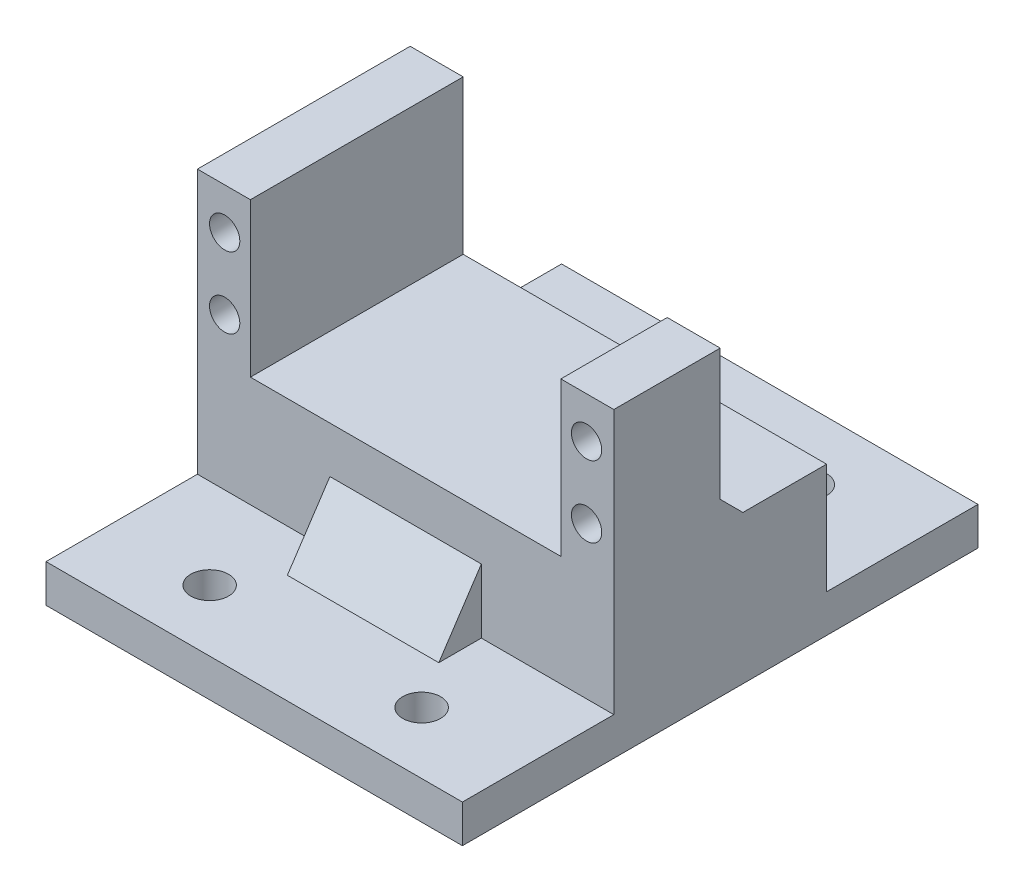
ISO-10303-21;
HEADER;
FILE_DESCRIPTION(('STEP AP214'),'2;1');
FILE_NAME('part.step','',(''),(''),'','','');
FILE_SCHEMA(('AUTOMOTIVE_DESIGN { 1 0 10303 214 1 1 1 1 }'));
ENDSEC;
DATA;
#1=APPLICATION_CONTEXT('core data for automotive mechanical design processes');
#2=APPLICATION_PROTOCOL_DEFINITION('international standard','automotive_design',2000,#1);
#3=PRODUCT_CONTEXT('',#1,'mechanical');
#4=PRODUCT('Part','Part','',(#3));
#5=PRODUCT_RELATED_PRODUCT_CATEGORY('part','',(#4));
#6=PRODUCT_DEFINITION_FORMATION('','',#4);
#7=PRODUCT_DEFINITION_CONTEXT('part definition',#1,'design');
#8=PRODUCT_DEFINITION('design','',#6,#7);
#9=PRODUCT_DEFINITION_SHAPE('','',#8);
#10=(LENGTH_UNIT() NAMED_UNIT(*) SI_UNIT(.MILLI.,.METRE.));
#11=(NAMED_UNIT(*) PLANE_ANGLE_UNIT() SI_UNIT($,.RADIAN.));
#12=(NAMED_UNIT(*) SI_UNIT($,.STERADIAN.) SOLID_ANGLE_UNIT());
#13=UNCERTAINTY_MEASURE_WITH_UNIT(LENGTH_MEASURE(1.E-05),#10,'distance_accuracy_value','');
#14=(GEOMETRIC_REPRESENTATION_CONTEXT(3) GLOBAL_UNCERTAINTY_ASSIGNED_CONTEXT((#13)) GLOBAL_UNIT_ASSIGNED_CONTEXT((#10,
#11,#12)) REPRESENTATION_CONTEXT('',''));
#15=CARTESIAN_POINT('',(0.,0.,0.));
#16=DIRECTION('',(0.,0.,1.));
#17=DIRECTION('',(1.,0.,0.));
#18=AXIS2_PLACEMENT_3D('',#15,#16,#17);
#19=CARTESIAN_POINT('',(-18.8461538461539,39.9,-12.2435897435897));
#20=DIRECTION('',(0.,0.,1.));
#21=DIRECTION('',(1.,0.,0.));
#22=AXIS2_PLACEMENT_3D('',#19,#20,#21);
#23=PLANE('',#22);
#24=CARTESIAN_POINT('',(-15.2461538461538,25.05,-12.2435897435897));
#25=DIRECTION('',(0.,0.,1.));
#26=DIRECTION('',(1.,0.,0.));
#27=AXIS2_PLACEMENT_3D('',#24,#25,#26);
#28=CIRCLE('',#27,2.);
#29=CARTESIAN_POINT('',(-13.2461538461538,25.05,-12.2435897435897));
#30=VERTEX_POINT('',#29);
#31=EDGE_CURVE('E265',#30,#30,#28,.T.);
#32=ORIENTED_EDGE('',*,*,#31,.T.);
#33=EDGE_LOOP('',(#32));
#34=FACE_BOUND('',#33,.T.);
#35=CARTESIAN_POINT('',(-15.2461538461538,34.45,-12.2435897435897));
#36=DIRECTION('',(0.,0.,1.));
#37=DIRECTION('',(1.,0.,0.));
#38=AXIS2_PLACEMENT_3D('',#35,#36,#37);
#39=CIRCLE('',#38,2.00000000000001);
#40=CARTESIAN_POINT('',(-13.2461538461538,34.45,-12.2435897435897));
#41=VERTEX_POINT('',#40);
#42=EDGE_CURVE('E226',#41,#41,#39,.T.);
#43=ORIENTED_EDGE('',*,*,#42,.T.);
#44=EDGE_LOOP('',(#43));
#45=FACE_BOUND('',#44,.T.);
#46=DIRECTION('',(-1.,0.,0.));
#47=VECTOR('',#46,1.);
#48=CARTESIAN_POINT('',(29.1538461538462,19.6,-12.2435897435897));
#49=LINE('',#48,#47);
#50=CARTESIAN_POINT('',(36.1538461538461,19.6,-12.2435897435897));
#51=VERTEX_POINT('',#50);
#52=CARTESIAN_POINT('',(-11.8461538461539,19.6,-12.2435897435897));
#53=VERTEX_POINT('',#52);
#54=EDGE_CURVE('E220',#51,#53,#49,.T.);
#55=ORIENTED_EDGE('',*,*,#54,.F.);
#56=DIRECTION('',(0.,-1.,0.));
#57=VECTOR('',#56,1.);
#58=CARTESIAN_POINT('',(36.1538461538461,39.9,-12.2435897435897));
#59=LINE('',#58,#57);
#60=CARTESIAN_POINT('',(36.1538461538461,5.,-12.2435897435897));
#61=VERTEX_POINT('',#60);
#62=EDGE_CURVE('E253',#51,#61,#59,.T.);
#63=ORIENTED_EDGE('',*,*,#62,.T.);
#64=DIRECTION('',(1.,0.,0.));
#65=VECTOR('',#64,1.);
#66=CARTESIAN_POINT('',(-39.4616819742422,5.,-12.2435897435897));
#67=LINE('',#66,#65);
#68=CARTESIAN_POINT('',(18.6538461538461,5.,-12.2435897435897));
#69=VERTEX_POINT('',#68);
#70=EDGE_CURVE('E365',#69,#61,#67,.T.);
#71=ORIENTED_EDGE('',*,*,#70,.F.);
#72=DIRECTION('',(0.,-1.,0.));
#73=VECTOR('',#72,1.);
#74=CARTESIAN_POINT('',(18.6538461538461,39.9,-12.2435897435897));
#75=LINE('',#74,#73);
#76=CARTESIAN_POINT('',(18.6538461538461,13.4786750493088,-12.2435897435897));
#77=VERTEX_POINT('',#76);
#78=EDGE_CURVE('E316',#77,#69,#75,.T.);
#79=ORIENTED_EDGE('',*,*,#78,.F.);
#80=DIRECTION('',(-1.,0.,0.));
#81=VECTOR('',#80,1.);
#82=CARTESIAN_POINT('',(-18.8461538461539,13.4786750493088,-12.2435897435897));
#83=LINE('',#82,#81);
#84=CARTESIAN_POINT('',(-1.34615384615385,13.4786750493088,-12.2435897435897));
#85=VERTEX_POINT('',#84);
#86=EDGE_CURVE('E322',#77,#85,#83,.T.);
#87=ORIENTED_EDGE('',*,*,#86,.T.);
#88=DIRECTION('',(0.,-1.,0.));
#89=VECTOR('',#88,1.);
#90=CARTESIAN_POINT('',(-1.34615384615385,39.9,-12.2435897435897));
#91=LINE('',#90,#89);
#92=CARTESIAN_POINT('',(-1.34615384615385,5.,-12.2435897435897));
#93=VERTEX_POINT('',#92);
#94=EDGE_CURVE('E320',#85,#93,#91,.T.);
#95=ORIENTED_EDGE('',*,*,#94,.T.);
#96=CARTESIAN_POINT('',(-18.8461538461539,5.,-12.2435897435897));
#97=VERTEX_POINT('',#96);
#98=EDGE_CURVE('E354',#97,#93,#67,.T.);
#99=ORIENTED_EDGE('',*,*,#98,.F.);
#100=DIRECTION('',(0.,-1.,0.));
#101=VECTOR('',#100,1.);
#102=CARTESIAN_POINT('',(-18.8461538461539,39.9,-12.2435897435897));
#103=LINE('',#102,#101);
#104=CARTESIAN_POINT('',(-18.8461538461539,39.9,-12.2435897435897));
#105=VERTEX_POINT('',#104);
#106=EDGE_CURVE('E247',#105,#97,#103,.T.);
#107=ORIENTED_EDGE('',*,*,#106,.F.);
#108=DIRECTION('',(-1.,0.,0.));
#109=VECTOR('',#108,1.);
#110=CARTESIAN_POINT('',(-18.8461538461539,39.9,-12.2435897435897));
#111=LINE('',#110,#109);
#112=CARTESIAN_POINT('',(-11.8461538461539,39.9,-12.2435897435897));
#113=VERTEX_POINT('',#112);
#114=EDGE_CURVE('E245',#113,#105,#111,.T.);
#115=ORIENTED_EDGE('',*,*,#114,.F.);
#116=DIRECTION('',(0.,1.,0.));
#117=VECTOR('',#116,1.);
#118=CARTESIAN_POINT('',(-11.8461538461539,19.6,-12.2435897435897));
#119=LINE('',#118,#117);
#120=EDGE_CURVE('E234',#53,#113,#119,.T.);
#121=ORIENTED_EDGE('',*,*,#120,.F.);
#122=EDGE_LOOP('',(#55,#63,#71,#79,#87,#95,#99,#107,#115,#121));
#123=FACE_BOUND('',#122,.T.);
#124=ADVANCED_FACE('F35',(#34,#45,#123),#23,.F.);
#125=CARTESIAN_POINT('',(-18.8461538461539,39.9,15.8564102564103));
#126=DIRECTION('',(0.,0.,-1.));
#127=DIRECTION('',(-1.,0.,0.));
#128=AXIS2_PLACEMENT_3D('',#125,#126,#127);
#129=PLANE('',#128);
#130=CARTESIAN_POINT('',(-15.2461538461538,34.45,15.8564102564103));
#131=DIRECTION('',(0.,0.,1.));
#132=DIRECTION('',(1.,0.,0.));
#133=AXIS2_PLACEMENT_3D('',#130,#131,#132);
#134=CIRCLE('',#133,2.00000000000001);
#135=CARTESIAN_POINT('',(-13.2461538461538,34.45,15.8564102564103));
#136=VERTEX_POINT('',#135);
#137=EDGE_CURVE('E264',#136,#136,#134,.T.);
#138=ORIENTED_EDGE('',*,*,#137,.F.);
#139=EDGE_LOOP('',(#138));
#140=FACE_BOUND('',#139,.T.);
#141=CARTESIAN_POINT('',(-15.2461538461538,25.05,15.8564102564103));
#142=DIRECTION('',(0.,0.,1.));
#143=DIRECTION('',(1.,0.,0.));
#144=AXIS2_PLACEMENT_3D('',#141,#142,#143);
#145=CIRCLE('',#144,2.);
#146=CARTESIAN_POINT('',(-13.2461538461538,25.05,15.8564102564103));
#147=VERTEX_POINT('',#146);
#148=EDGE_CURVE('E268',#147,#147,#145,.T.);
#149=ORIENTED_EDGE('',*,*,#148,.F.);
#150=EDGE_LOOP('',(#149));
#151=FACE_BOUND('',#150,.T.);
#152=DIRECTION('',(1.,0.,0.));
#153=VECTOR('',#152,1.);
#154=CARTESIAN_POINT('',(-39.4616819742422,5.,15.8564102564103));
#155=LINE('',#154,#153);
#156=CARTESIAN_POINT('',(-18.8461538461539,5.,15.8564102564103));
#157=VERTEX_POINT('',#156);
#158=CARTESIAN_POINT('',(-1.34615384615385,5.,15.8564102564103));
#159=VERTEX_POINT('',#158);
#160=EDGE_CURVE('E384',#157,#159,#155,.T.);
#161=ORIENTED_EDGE('',*,*,#160,.T.);
#162=DIRECTION('',(0.,1.,0.));
#163=VECTOR('',#162,1.);
#164=CARTESIAN_POINT('',(-1.34615384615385,39.9,15.8564102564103));
#165=LINE('',#164,#163);
#166=CARTESIAN_POINT('',(-1.34615384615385,13.4786750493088,15.8564102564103));
#167=VERTEX_POINT('',#166);
#168=EDGE_CURVE('E307',#159,#167,#165,.T.);
#169=ORIENTED_EDGE('',*,*,#168,.T.);
#170=DIRECTION('',(-1.,0.,0.));
#171=VECTOR('',#170,1.);
#172=CARTESIAN_POINT('',(-18.8461538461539,13.4786750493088,15.8564102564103));
#173=LINE('',#172,#171);
#174=CARTESIAN_POINT('',(18.6538461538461,13.4786750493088,15.8564102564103));
#175=VERTEX_POINT('',#174);
#176=EDGE_CURVE('E309',#167,#175,#173,.F.);
#177=ORIENTED_EDGE('',*,*,#176,.T.);
#178=DIRECTION('',(0.,1.,0.));
#179=VECTOR('',#178,1.);
#180=CARTESIAN_POINT('',(18.6538461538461,39.9,15.8564102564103));
#181=LINE('',#180,#179);
#182=CARTESIAN_POINT('',(18.6538461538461,5.,15.8564102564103));
#183=VERTEX_POINT('',#182);
#184=EDGE_CURVE('E303',#183,#175,#181,.T.);
#185=ORIENTED_EDGE('',*,*,#184,.F.);
#186=CARTESIAN_POINT('',(36.1538461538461,5.,15.8564102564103));
#187=VERTEX_POINT('',#186);
#188=EDGE_CURVE('E380',#183,#187,#155,.T.);
#189=ORIENTED_EDGE('',*,*,#188,.T.);
#190=DIRECTION('',(0.,-1.,0.));
#191=VECTOR('',#190,1.);
#192=CARTESIAN_POINT('',(36.1538461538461,39.9,15.8564102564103));
#193=LINE('',#192,#191);
#194=CARTESIAN_POINT('',(36.1538461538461,39.9,15.8564102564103));
#195=VERTEX_POINT('',#194);
#196=EDGE_CURVE('E255',#195,#187,#193,.T.);
#197=ORIENTED_EDGE('',*,*,#196,.F.);
#198=DIRECTION('',(1.,0.,0.));
#199=VECTOR('',#198,1.);
#200=CARTESIAN_POINT('',(-18.8461538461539,39.9,15.8564102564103));
#201=LINE('',#200,#199);
#202=CARTESIAN_POINT('',(29.1538461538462,39.9,15.8564102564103));
#203=VERTEX_POINT('',#202);
#204=EDGE_CURVE('E239',#203,#195,#201,.T.);
#205=ORIENTED_EDGE('',*,*,#204,.F.);
#206=DIRECTION('',(0.,1.,0.));
#207=VECTOR('',#206,1.);
#208=CARTESIAN_POINT('',(29.1538461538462,19.6,15.8564102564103));
#209=LINE('',#208,#207);
#210=CARTESIAN_POINT('',(29.1538461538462,19.6,15.8564102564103));
#211=VERTEX_POINT('',#210);
#212=EDGE_CURVE('E219',#211,#203,#209,.T.);
#213=ORIENTED_EDGE('',*,*,#212,.F.);
#214=DIRECTION('',(1.,0.,0.));
#215=VECTOR('',#214,1.);
#216=CARTESIAN_POINT('',(-11.8461538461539,19.6,15.8564102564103));
#217=LINE('',#216,#215);
#218=CARTESIAN_POINT('',(-11.8461538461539,19.6,15.8564102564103));
#219=VERTEX_POINT('',#218);
#220=EDGE_CURVE('E427',#219,#211,#217,.T.);
#221=ORIENTED_EDGE('',*,*,#220,.F.);
#222=DIRECTION('',(0.,1.,0.));
#223=VECTOR('',#222,1.);
#224=CARTESIAN_POINT('',(-11.8461538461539,19.6,15.8564102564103));
#225=LINE('',#224,#223);
#226=CARTESIAN_POINT('',(-11.8461538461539,39.9,15.8564102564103));
#227=VERTEX_POINT('',#226);
#228=EDGE_CURVE('E232',#219,#227,#225,.T.);
#229=ORIENTED_EDGE('',*,*,#228,.T.);
#230=CARTESIAN_POINT('',(-18.8461538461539,39.9,15.8564102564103));
#231=VERTEX_POINT('',#230);
#232=EDGE_CURVE('E241',#231,#227,#201,.T.);
#233=ORIENTED_EDGE('',*,*,#232,.F.);
#234=DIRECTION('',(0.,-1.,0.));
#235=VECTOR('',#234,1.);
#236=CARTESIAN_POINT('',(-18.8461538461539,39.9,15.8564102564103));
#237=LINE('',#236,#235);
#238=EDGE_CURVE('E258',#231,#157,#237,.T.);
#239=ORIENTED_EDGE('',*,*,#238,.T.);
#240=EDGE_LOOP('',(#161,#169,#177,#185,#189,#197,#205,#213,#221,#229,#233,#239));
#241=FACE_BOUND('',#240,.T.);
#242=CARTESIAN_POINT('',(32.5538461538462,34.45,15.8564102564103));
#243=DIRECTION('',(0.,0.,1.));
#244=DIRECTION('',(1.,0.,0.));
#245=AXIS2_PLACEMENT_3D('',#242,#243,#244);
#246=CIRCLE('',#245,2.);
#247=CARTESIAN_POINT('',(34.5538461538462,34.45,15.8564102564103));
#248=VERTEX_POINT('',#247);
#249=EDGE_CURVE('E418',#248,#248,#246,.T.);
#250=ORIENTED_EDGE('',*,*,#249,.F.);
#251=EDGE_LOOP('',(#250));
#252=FACE_BOUND('',#251,.T.);
#253=CARTESIAN_POINT('',(32.5538461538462,25.05,15.8564102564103));
#254=DIRECTION('',(0.,0.,1.));
#255=DIRECTION('',(1.,0.,0.));
#256=AXIS2_PLACEMENT_3D('',#253,#254,#255);
#257=CIRCLE('',#256,2.);
#258=CARTESIAN_POINT('',(34.5538461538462,25.05,15.8564102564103));
#259=VERTEX_POINT('',#258);
#260=EDGE_CURVE('E409',#259,#259,#257,.T.);
#261=ORIENTED_EDGE('',*,*,#260,.F.);
#262=EDGE_LOOP('',(#261));
#263=FACE_BOUND('',#262,.T.);
#264=ADVANCED_FACE('F432',(#140,#151,#241,#252,#263),#129,.F.);
#265=CARTESIAN_POINT('',(0.,39.9,0.));
#266=DIRECTION('',(0.,1.,0.));
#267=DIRECTION('',(0.,0.,1.));
#268=AXIS2_PLACEMENT_3D('',#265,#266,#267);
#269=PLANE('',#268);
#270=DIRECTION('',(1.,0.,0.));
#271=VECTOR('',#270,1.);
#272=CARTESIAN_POINT('',(29.1538461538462,39.9,1.80641025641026));
#273=LINE('',#272,#271);
#274=CARTESIAN_POINT('',(29.1538461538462,39.9,1.80641025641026));
#275=VERTEX_POINT('',#274);
#276=CARTESIAN_POINT('',(36.1538461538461,39.9,1.80641025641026));
#277=VERTEX_POINT('',#276);
#278=EDGE_CURVE('E201',#275,#277,#273,.T.);
#279=ORIENTED_EDGE('',*,*,#278,.F.);
#280=DIRECTION('',(0.,0.,-1.));
#281=VECTOR('',#280,1.);
#282=CARTESIAN_POINT('',(29.1538461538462,39.9,15.8564102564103));
#283=LINE('',#282,#281);
#284=EDGE_CURVE('E212',#203,#275,#283,.T.);
#285=ORIENTED_EDGE('',*,*,#284,.F.);
#286=ORIENTED_EDGE('',*,*,#204,.T.);
#287=DIRECTION('',(0.,0.,-1.));
#288=VECTOR('',#287,1.);
#289=CARTESIAN_POINT('',(36.1538461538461,39.9,-12.2435897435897));
#290=LINE('',#289,#288);
#291=EDGE_CURVE('E215',#195,#277,#290,.T.);
#292=ORIENTED_EDGE('',*,*,#291,.T.);
#293=EDGE_LOOP('',(#279,#285,#286,#292));
#294=FACE_BOUND('',#293,.T.);
#295=ADVANCED_FACE('F211',(#294),#269,.T.);
#296=CARTESIAN_POINT('',(-18.8461538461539,39.9,-12.2435897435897));
#297=DIRECTION('',(1.,0.,0.));
#298=DIRECTION('',(0.,0.,-1.));
#299=AXIS2_PLACEMENT_3D('',#296,#297,#298);
#300=PLANE('',#299);
#301=ORIENTED_EDGE('',*,*,#106,.T.);
#302=DIRECTION('',(0.,0.,-1.));
#303=VECTOR('',#302,1.);
#304=CARTESIAN_POINT('',(-18.8461538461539,5.,-32.2435897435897));
#305=LINE('',#304,#303);
#306=CARTESIAN_POINT('',(-18.8461538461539,5.,-32.2435897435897));
#307=VERTEX_POINT('',#306);
#308=EDGE_CURVE('E353',#97,#307,#305,.T.);
#309=ORIENTED_EDGE('',*,*,#308,.T.);
#310=DIRECTION('',(0.,-1.,0.));
#311=VECTOR('',#310,1.);
#312=CARTESIAN_POINT('',(-18.8461538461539,0.,-32.2435897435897));
#313=LINE('',#312,#311);
#314=CARTESIAN_POINT('',(-18.8461538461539,0.,-32.2435897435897));
#315=VERTEX_POINT('',#314);
#316=EDGE_CURVE('E350',#307,#315,#313,.T.);
#317=ORIENTED_EDGE('',*,*,#316,.T.);
#318=DIRECTION('',(0.,0.,1.));
#319=VECTOR('',#318,1.);
#320=CARTESIAN_POINT('',(-18.8461538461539,0.,-12.2435897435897));
#321=LINE('',#320,#319);
#322=CARTESIAN_POINT('',(-18.8461538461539,0.,35.8564102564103));
#323=VERTEX_POINT('',#322);
#324=EDGE_CURVE('E231',#315,#323,#321,.T.);
#325=ORIENTED_EDGE('',*,*,#324,.T.);
#326=DIRECTION('',(0.,1.,0.));
#327=VECTOR('',#326,1.);
#328=CARTESIAN_POINT('',(-18.8461538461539,0.,35.8564102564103));
#329=LINE('',#328,#327);
#330=CARTESIAN_POINT('',(-18.8461538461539,4.99999999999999,35.8564102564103));
#331=VERTEX_POINT('',#330);
#332=EDGE_CURVE('E371',#323,#331,#329,.T.);
#333=ORIENTED_EDGE('',*,*,#332,.T.);
#334=DIRECTION('',(0.,0.,-1.));
#335=VECTOR('',#334,1.);
#336=CARTESIAN_POINT('',(-18.8461538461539,4.99999999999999,35.8564102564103));
#337=LINE('',#336,#335);
#338=EDGE_CURVE('E373',#331,#157,#337,.T.);
#339=ORIENTED_EDGE('',*,*,#338,.T.);
#340=ORIENTED_EDGE('',*,*,#238,.F.);
#341=DIRECTION('',(0.,0.,1.));
#342=VECTOR('',#341,1.);
#343=CARTESIAN_POINT('',(-18.8461538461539,39.9,-12.2435897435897));
#344=LINE('',#343,#342);
#345=EDGE_CURVE('E236',#105,#231,#344,.T.);
#346=ORIENTED_EDGE('',*,*,#345,.F.);
#347=EDGE_LOOP('',(#301,#309,#317,#325,#333,#339,#340,#346));
#348=FACE_BOUND('',#347,.T.);
#349=ADVANCED_FACE('F481',(#348),#300,.F.);
#350=CARTESIAN_POINT('',(36.1538461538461,39.9,-12.2435897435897));
#351=DIRECTION('',(-1.,0.,0.));
#352=DIRECTION('',(0.,0.,1.));
#353=AXIS2_PLACEMENT_3D('',#350,#351,#352);
#354=PLANE('',#353);
#355=DIRECTION('',(0.,0.,1.));
#356=VECTOR('',#355,1.);
#357=CARTESIAN_POINT('',(36.1538461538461,19.6,-2.24358974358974));
#358=LINE('',#357,#356);
#359=CARTESIAN_POINT('',(36.1538461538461,19.6,-1.19358974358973));
#360=VERTEX_POINT('',#359);
#361=EDGE_CURVE('E283',#51,#360,#358,.T.);
#362=ORIENTED_EDGE('',*,*,#361,.T.);
#363=DIRECTION('',(0.,0.707106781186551,0.707106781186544));
#364=VECTOR('',#363,1.);
#365=CARTESIAN_POINT('',(36.1538461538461,24.2250000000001,3.43141025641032));
#366=LINE('',#365,#364);
#367=CARTESIAN_POINT('',(36.1538461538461,22.6,1.80641025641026));
#368=VERTEX_POINT('',#367);
#369=EDGE_CURVE('E11',#360,#368,#366,.T.);
#370=ORIENTED_EDGE('',*,*,#369,.T.);
#371=DIRECTION('',(0.,1.,0.));
#372=VECTOR('',#371,1.);
#373=CARTESIAN_POINT('',(36.1538461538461,3.90278687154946,1.80641025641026));
#374=LINE('',#373,#372);
#375=EDGE_CURVE('E207',#368,#277,#374,.T.);
#376=ORIENTED_EDGE('',*,*,#375,.T.);
#377=ORIENTED_EDGE('',*,*,#291,.F.);
#378=ORIENTED_EDGE('',*,*,#196,.T.);
#379=DIRECTION('',(0.,0.,1.));
#380=VECTOR('',#379,1.);
#381=CARTESIAN_POINT('',(36.1538461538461,4.99999999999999,35.8564102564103));
#382=LINE('',#381,#380);
#383=CARTESIAN_POINT('',(36.1538461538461,4.99999999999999,35.8564102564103));
#384=VERTEX_POINT('',#383);
#385=EDGE_CURVE('E356',#187,#384,#382,.T.);
#386=ORIENTED_EDGE('',*,*,#385,.T.);
#387=DIRECTION('',(0.,-1.,0.));
#388=VECTOR('',#387,1.);
#389=CARTESIAN_POINT('',(36.1538461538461,0.,35.8564102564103));
#390=LINE('',#389,#388);
#391=CARTESIAN_POINT('',(36.1538461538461,0.,35.8564102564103));
#392=VERTEX_POINT('',#391);
#393=EDGE_CURVE('E377',#384,#392,#390,.T.);
#394=ORIENTED_EDGE('',*,*,#393,.T.);
#395=DIRECTION('',(0.,0.,-1.));
#396=VECTOR('',#395,1.);
#397=CARTESIAN_POINT('',(36.1538461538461,0.,-12.2435897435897));
#398=LINE('',#397,#396);
#399=CARTESIAN_POINT('',(36.1538461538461,0.,-32.2435897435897));
#400=VERTEX_POINT('',#399);
#401=EDGE_CURVE('E240',#392,#400,#398,.T.);
#402=ORIENTED_EDGE('',*,*,#401,.T.);
#403=DIRECTION('',(0.,1.,0.));
#404=VECTOR('',#403,1.);
#405=CARTESIAN_POINT('',(36.1538461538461,0.,-32.2435897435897));
#406=LINE('',#405,#404);
#407=CARTESIAN_POINT('',(36.1538461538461,5.,-32.2435897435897));
#408=VERTEX_POINT('',#407);
#409=EDGE_CURVE('E349',#400,#408,#406,.T.);
#410=ORIENTED_EDGE('',*,*,#409,.T.);
#411=DIRECTION('',(0.,0.,1.));
#412=VECTOR('',#411,1.);
#413=CARTESIAN_POINT('',(36.1538461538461,5.,-32.2435897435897));
#414=LINE('',#413,#412);
#415=EDGE_CURVE('E359',#408,#61,#414,.T.);
#416=ORIENTED_EDGE('',*,*,#415,.T.);
#417=ORIENTED_EDGE('',*,*,#62,.F.);
#418=EDGE_LOOP('',(#362,#370,#376,#377,#378,#386,#394,#402,#410,#416,#417));
#419=FACE_BOUND('',#418,.T.);
#420=ADVANCED_FACE('F288',(#419),#354,.F.);
#421=DIRECTION('',(0.,0.,1.));
#422=VECTOR('',#421,1.);
#423=CARTESIAN_POINT('',(-11.8461538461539,39.9,-12.2435897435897));
#424=LINE('',#423,#422);
#425=EDGE_CURVE('E221',#113,#227,#424,.T.);
#426=ORIENTED_EDGE('',*,*,#425,.F.);
#427=ORIENTED_EDGE('',*,*,#114,.T.);
#428=ORIENTED_EDGE('',*,*,#345,.T.);
#429=ORIENTED_EDGE('',*,*,#232,.T.);
#430=EDGE_LOOP('',(#426,#427,#428,#429));
#431=FACE_BOUND('',#430,.T.);
#432=ADVANCED_FACE('F479',(#431),#269,.T.);
#433=CARTESIAN_POINT('',(0.,0.,0.));
#434=DIRECTION('',(0.,1.,0.));
#435=DIRECTION('',(0.,0.,1.));
#436=AXIS2_PLACEMENT_3D('',#433,#434,#435);
#437=PLANE('',#436);
#438=DIRECTION('',(0.,0.,-1.));
#439=VECTOR('',#438,1.);
#440=CARTESIAN_POINT('',(26.2871918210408,0.,-11.2435897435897));
#441=LINE('',#440,#439);
#442=CARTESIAN_POINT('',(26.2871918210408,0.,-11.2435897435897));
#443=VERTEX_POINT('',#442);
#444=CARTESIAN_POINT('',(26.2871918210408,0.,-12.2435897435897));
#445=VERTEX_POINT('',#444);
#446=EDGE_CURVE('E399',#443,#445,#441,.T.);
#447=ORIENTED_EDGE('',*,*,#446,.T.);
#448=DIRECTION('',(1.,0.,0.));
#449=VECTOR('',#448,1.);
#450=CARTESIAN_POINT('',(-39.4616819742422,0.,-12.2435897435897));
#451=LINE('',#450,#449);
#452=CARTESIAN_POINT('',(-10.545838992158,0.,-12.2435897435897));
#453=VERTEX_POINT('',#452);
#454=EDGE_CURVE('E362',#453,#445,#451,.T.);
#455=ORIENTED_EDGE('',*,*,#454,.F.);
#456=DIRECTION('',(0.,0.,-1.));
#457=VECTOR('',#456,1.);
#458=CARTESIAN_POINT('',(-10.545838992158,0.,-11.2435897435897));
#459=LINE('',#458,#457);
#460=CARTESIAN_POINT('',(-10.545838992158,0.,-11.2435897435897));
#461=VERTEX_POINT('',#460);
#462=EDGE_CURVE('E412',#461,#453,#459,.T.);
#463=ORIENTED_EDGE('',*,*,#462,.F.);
#464=DIRECTION('',(-1.,0.,0.));
#465=VECTOR('',#464,1.);
#466=CARTESIAN_POINT('',(26.2871918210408,0.,-11.2435897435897));
#467=LINE('',#466,#465);
#468=EDGE_CURVE('E391',#443,#461,#467,.T.);
#469=ORIENTED_EDGE('',*,*,#468,.F.);
#470=EDGE_LOOP('',(#447,#455,#463,#469));
#471=FACE_BOUND('',#470,.T.);
#472=DIRECTION('',(1.,0.,0.));
#473=VECTOR('',#472,1.);
#474=CARTESIAN_POINT('',(-39.4616819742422,0.,-32.2435897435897));
#475=LINE('',#474,#473);
#476=EDGE_CURVE('E368',#315,#400,#475,.T.);
#477=ORIENTED_EDGE('',*,*,#476,.T.);
#478=ORIENTED_EDGE('',*,*,#401,.F.);
#479=DIRECTION('',(1.,0.,0.));
#480=VECTOR('',#479,1.);
#481=CARTESIAN_POINT('',(-39.4616819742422,0.,35.8564102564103));
#482=LINE('',#481,#480);
#483=EDGE_CURVE('E374',#323,#392,#482,.T.);
#484=ORIENTED_EDGE('',*,*,#483,.F.);
#485=ORIENTED_EDGE('',*,*,#324,.F.);
#486=EDGE_LOOP('',(#477,#478,#484,#485));
#487=FACE_BOUND('',#486,.T.);
#488=CARTESIAN_POINT('',(22.6538461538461,0.,-23.2641644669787));
#489=DIRECTION('',(0.,1.,0.));
#490=DIRECTION('',(0.,0.,1.));
#491=AXIS2_PLACEMENT_3D('',#488,#489,#490);
#492=CIRCLE('',#491,2.5);
#493=CARTESIAN_POINT('',(22.6538461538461,0.,-20.7641644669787));
#494=VERTEX_POINT('',#493);
#495=EDGE_CURVE('E329',#494,#494,#492,.T.);
#496=ORIENTED_EDGE('',*,*,#495,.T.);
#497=EDGE_LOOP('',(#496));
#498=FACE_BOUND('',#497,.T.);
#499=CARTESIAN_POINT('',(-5.34615384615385,0.,27.740984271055));
#500=DIRECTION('',(0.,1.,0.));
#501=DIRECTION('',(0.,0.,1.));
#502=AXIS2_PLACEMENT_3D('',#499,#500,#501);
#503=CIRCLE('',#502,2.5);
#504=CARTESIAN_POINT('',(-5.34615384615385,0.,30.240984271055));
#505=VERTEX_POINT('',#504);
#506=EDGE_CURVE('E340',#505,#505,#503,.T.);
#507=ORIENTED_EDGE('',*,*,#506,.T.);
#508=EDGE_LOOP('',(#507));
#509=FACE_BOUND('',#508,.T.);
#510=CARTESIAN_POINT('',(22.6538461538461,0.,27.740984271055));
#511=DIRECTION('',(0.,1.,0.));
#512=DIRECTION('',(0.,0.,1.));
#513=AXIS2_PLACEMENT_3D('',#510,#511,#512);
#514=CIRCLE('',#513,2.5);
#515=CARTESIAN_POINT('',(22.6538461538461,0.,30.240984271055));
#516=VERTEX_POINT('',#515);
#517=EDGE_CURVE('E337',#516,#516,#514,.T.);
#518=ORIENTED_EDGE('',*,*,#517,.T.);
#519=EDGE_LOOP('',(#518));
#520=FACE_BOUND('',#519,.T.);
#521=CARTESIAN_POINT('',(-5.34615384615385,0.,-23.2641644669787));
#522=DIRECTION('',(0.,1.,0.));
#523=DIRECTION('',(0.,0.,1.));
#524=AXIS2_PLACEMENT_3D('',#521,#522,#523);
#525=CIRCLE('',#524,2.5);
#526=CARTESIAN_POINT('',(-5.34615384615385,0.,-20.7641644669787));
#527=VERTEX_POINT('',#526);
#528=EDGE_CURVE('E346',#527,#527,#525,.T.);
#529=ORIENTED_EDGE('',*,*,#528,.T.);
#530=EDGE_LOOP('',(#529));
#531=FACE_BOUND('',#530,.T.);
#532=ADVANCED_FACE('F452',(#471,#487,#498,#509,#520,#531),#437,.F.);
#533=CARTESIAN_POINT('',(29.1538461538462,19.6,15.8564102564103));
#534=DIRECTION('',(1.,0.,0.));
#535=DIRECTION('',(0.,0.,-1.));
#536=AXIS2_PLACEMENT_3D('',#533,#534,#535);
#537=PLANE('',#536);
#538=ORIENTED_EDGE('',*,*,#284,.T.);
#539=DIRECTION('',(0.,1.,0.));
#540=VECTOR('',#539,1.);
#541=CARTESIAN_POINT('',(29.1538461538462,3.90278687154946,1.80641025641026));
#542=LINE('',#541,#540);
#543=CARTESIAN_POINT('',(29.1538461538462,22.6,1.80641025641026));
#544=VERTEX_POINT('',#543);
#545=EDGE_CURVE('E196',#544,#275,#542,.T.);
#546=ORIENTED_EDGE('',*,*,#545,.F.);
#547=DIRECTION('',(0.,-0.707106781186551,-0.707106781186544));
#548=VECTOR('',#547,1.);
#549=CARTESIAN_POINT('',(29.1538461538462,28.125,7.33141025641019));
#550=LINE('',#549,#548);
#551=CARTESIAN_POINT('',(29.1538461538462,19.6,-1.19358974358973));
#552=VERTEX_POINT('',#551);
#553=EDGE_CURVE('E43',#544,#552,#550,.T.);
#554=ORIENTED_EDGE('',*,*,#553,.T.);
#555=DIRECTION('',(0.,0.,-1.));
#556=VECTOR('',#555,1.);
#557=CARTESIAN_POINT('',(29.1538461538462,19.6,15.8564102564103));
#558=LINE('',#557,#556);
#559=EDGE_CURVE('E50',#211,#552,#558,.T.);
#560=ORIENTED_EDGE('',*,*,#559,.F.);
#561=ORIENTED_EDGE('',*,*,#212,.T.);
#562=EDGE_LOOP('',(#538,#546,#554,#560,#561));
#563=FACE_BOUND('',#562,.T.);
#564=ADVANCED_FACE('F217',(#563),#537,.F.);
#565=CARTESIAN_POINT('',(-11.8461538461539,19.6,-12.2435897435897));
#566=DIRECTION('',(-1.,0.,0.));
#567=DIRECTION('',(0.,0.,1.));
#568=AXIS2_PLACEMENT_3D('',#565,#566,#567);
#569=PLANE('',#568);
#570=ORIENTED_EDGE('',*,*,#425,.T.);
#571=ORIENTED_EDGE('',*,*,#228,.F.);
#572=DIRECTION('',(0.,0.,1.));
#573=VECTOR('',#572,1.);
#574=CARTESIAN_POINT('',(-11.8461538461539,19.6,-12.2435897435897));
#575=LINE('',#574,#573);
#576=EDGE_CURVE('E223',#53,#219,#575,.T.);
#577=ORIENTED_EDGE('',*,*,#576,.F.);
#578=ORIENTED_EDGE('',*,*,#120,.T.);
#579=EDGE_LOOP('',(#570,#571,#577,#578));
#580=FACE_BOUND('',#579,.T.);
#581=ADVANCED_FACE('F475',(#580),#569,.F.);
#582=CARTESIAN_POINT('',(0.,19.6,0.));
#583=DIRECTION('',(0.,1.,0.));
#584=DIRECTION('',(0.,0.,1.));
#585=AXIS2_PLACEMENT_3D('',#582,#583,#584);
#586=PLANE('',#585);
#587=ORIENTED_EDGE('',*,*,#559,.T.);
#588=DIRECTION('',(1.,0.,0.));
#589=VECTOR('',#588,1.);
#590=CARTESIAN_POINT('',(0.,19.6,-1.19358974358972));
#591=LINE('',#590,#589);
#592=EDGE_CURVE('E55',#552,#360,#591,.T.);
#593=ORIENTED_EDGE('',*,*,#592,.T.);
#594=ORIENTED_EDGE('',*,*,#361,.F.);
#595=ORIENTED_EDGE('',*,*,#54,.T.);
#596=ORIENTED_EDGE('',*,*,#576,.T.);
#597=ORIENTED_EDGE('',*,*,#220,.T.);
#598=EDGE_LOOP('',(#587,#593,#594,#595,#596,#597));
#599=FACE_BOUND('',#598,.T.);
#600=ADVANCED_FACE('F428',(#599),#586,.T.);
#601=CARTESIAN_POINT('',(-15.2461538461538,34.45,-22.1435897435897));
#602=DIRECTION('',(0.,0.,1.));
#603=DIRECTION('',(1.,0.,0.));
#604=AXIS2_PLACEMENT_3D('',#601,#602,#603);
#605=CYLINDRICAL_SURFACE('',#604,2.00000000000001);
#606=ORIENTED_EDGE('',*,*,#137,.T.);
#607=EDGE_LOOP('',(#606));
#608=FACE_BOUND('',#607,.T.);
#609=ORIENTED_EDGE('',*,*,#42,.F.);
#610=EDGE_LOOP('',(#609));
#611=FACE_BOUND('',#610,.T.);
#612=ADVANCED_FACE('F578',(#608,#611),#605,.F.);
#613=CARTESIAN_POINT('',(32.5538461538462,25.05,-22.1435897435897));
#614=DIRECTION('',(0.,0.,1.));
#615=DIRECTION('',(1.,0.,0.));
#616=AXIS2_PLACEMENT_3D('',#613,#614,#615);
#617=CYLINDRICAL_SURFACE('',#616,2.);
#618=CARTESIAN_POINT('',(32.5538461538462,25.05,1.80641025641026));
#619=DIRECTION('',(0.,0.,1.));
#620=DIRECTION('',(1.,0.,0.));
#621=AXIS2_PLACEMENT_3D('',#618,#619,#620);
#622=CIRCLE('',#621,2.);
#623=CARTESIAN_POINT('',(34.5538461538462,25.05,1.80641025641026));
#624=VERTEX_POINT('',#623);
#625=EDGE_CURVE('E282',#624,#624,#622,.F.);
#626=ORIENTED_EDGE('',*,*,#625,.T.);
#627=EDGE_LOOP('',(#626));
#628=FACE_BOUND('',#627,.T.);
#629=ORIENTED_EDGE('',*,*,#260,.T.);
#630=EDGE_LOOP('',(#629));
#631=FACE_BOUND('',#630,.T.);
#632=ADVANCED_FACE('F574',(#628,#631),#617,.F.);
#633=CARTESIAN_POINT('',(32.5538461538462,34.45,-22.1435897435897));
#634=DIRECTION('',(0.,0.,1.));
#635=DIRECTION('',(1.,0.,0.));
#636=AXIS2_PLACEMENT_3D('',#633,#634,#635);
#637=CYLINDRICAL_SURFACE('',#636,2.);
#638=CARTESIAN_POINT('',(32.5538461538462,34.45,1.80641025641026));
#639=DIRECTION('',(0.,0.,1.));
#640=DIRECTION('',(1.,0.,0.));
#641=AXIS2_PLACEMENT_3D('',#638,#639,#640);
#642=CIRCLE('',#641,2.);
#643=CARTESIAN_POINT('',(34.5538461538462,34.45,1.80641025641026));
#644=VERTEX_POINT('',#643);
#645=EDGE_CURVE('E279',#644,#644,#642,.F.);
#646=ORIENTED_EDGE('',*,*,#645,.T.);
#647=EDGE_LOOP('',(#646));
#648=FACE_BOUND('',#647,.T.);
#649=ORIENTED_EDGE('',*,*,#249,.T.);
#650=EDGE_LOOP('',(#649));
#651=FACE_BOUND('',#650,.T.);
#652=ADVANCED_FACE('F570',(#648,#651),#637,.F.);
#653=CARTESIAN_POINT('',(-15.2461538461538,25.05,-22.1435897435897));
#654=DIRECTION('',(0.,0.,1.));
#655=DIRECTION('',(1.,0.,0.));
#656=AXIS2_PLACEMENT_3D('',#653,#654,#655);
#657=CYLINDRICAL_SURFACE('',#656,2.);
#658=ORIENTED_EDGE('',*,*,#148,.T.);
#659=EDGE_LOOP('',(#658));
#660=FACE_BOUND('',#659,.T.);
#661=ORIENTED_EDGE('',*,*,#31,.F.);
#662=EDGE_LOOP('',(#661));
#663=FACE_BOUND('',#662,.T.);
#664=ADVANCED_FACE('F563',(#660,#663),#657,.F.);
#665=CARTESIAN_POINT('',(26.2871918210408,0.,-11.2435897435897));
#666=DIRECTION('',(1.,0.,0.));
#667=DIRECTION('',(0.,0.,-1.));
#668=AXIS2_PLACEMENT_3D('',#665,#666,#667);
#669=PLANE('',#668);
#670=DIRECTION('',(0.,-1.,0.));
#671=VECTOR('',#670,1.);
#672=CARTESIAN_POINT('',(26.2871918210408,0.,-12.2435897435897));
#673=LINE('',#672,#671);
#674=CARTESIAN_POINT('',(26.2871918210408,2.88810167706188,-12.2435897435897));
#675=VERTEX_POINT('',#674);
#676=EDGE_CURVE('E388',#675,#445,#673,.T.);
#677=ORIENTED_EDGE('',*,*,#676,.T.);
#678=ORIENTED_EDGE('',*,*,#446,.F.);
#679=DIRECTION('',(0.,-1.,0.));
#680=VECTOR('',#679,1.);
#681=CARTESIAN_POINT('',(26.2871918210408,0.,-11.2435897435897));
#682=LINE('',#681,#680);
#683=CARTESIAN_POINT('',(26.2871918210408,2.88810167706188,-11.2435897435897));
#684=VERTEX_POINT('',#683);
#685=EDGE_CURVE('E389',#684,#443,#682,.T.);
#686=ORIENTED_EDGE('',*,*,#685,.F.);
#687=DIRECTION('',(0.,0.,-1.));
#688=VECTOR('',#687,1.);
#689=CARTESIAN_POINT('',(26.2871918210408,2.88810167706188,-11.2435897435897));
#690=LINE('',#689,#688);
#691=EDGE_CURVE('E406',#684,#675,#690,.T.);
#692=ORIENTED_EDGE('',*,*,#691,.T.);
#693=EDGE_LOOP('',(#677,#678,#686,#692));
#694=FACE_BOUND('',#693,.T.);
#695=ADVANCED_FACE('F541',(#694),#669,.F.);
#696=CARTESIAN_POINT('',(26.2871918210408,2.88810167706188,-11.2435897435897));
#697=DIRECTION('',(0.,1.,0.));
#698=DIRECTION('',(0.,0.,1.));
#699=AXIS2_PLACEMENT_3D('',#696,#697,#698);
#700=PLANE('',#699);
#701=DIRECTION('',(1.,0.,0.));
#702=VECTOR('',#701,1.);
#703=CARTESIAN_POINT('',(26.2871918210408,2.88810167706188,-12.2435897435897));
#704=LINE('',#703,#702);
#705=CARTESIAN_POINT('',(-10.545838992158,2.88810167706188,-12.2435897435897));
#706=VERTEX_POINT('',#705);
#707=EDGE_CURVE('E392',#706,#675,#704,.T.);
#708=ORIENTED_EDGE('',*,*,#707,.T.);
#709=ORIENTED_EDGE('',*,*,#691,.F.);
#710=DIRECTION('',(1.,0.,0.));
#711=VECTOR('',#710,1.);
#712=CARTESIAN_POINT('',(26.2871918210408,2.88810167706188,-11.2435897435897));
#713=LINE('',#712,#711);
#714=CARTESIAN_POINT('',(-10.545838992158,2.88810167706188,-11.2435897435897));
#715=VERTEX_POINT('',#714);
#716=EDGE_CURVE('E397',#715,#684,#713,.T.);
#717=ORIENTED_EDGE('',*,*,#716,.F.);
#718=DIRECTION('',(0.,0.,-1.));
#719=VECTOR('',#718,1.);
#720=CARTESIAN_POINT('',(-10.545838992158,2.88810167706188,-11.2435897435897));
#721=LINE('',#720,#719);
#722=EDGE_CURVE('E410',#715,#706,#721,.T.);
#723=ORIENTED_EDGE('',*,*,#722,.T.);
#724=EDGE_LOOP('',(#708,#709,#717,#723));
#725=FACE_BOUND('',#724,.T.);
#726=ADVANCED_FACE('F555',(#725),#700,.F.);
#727=CARTESIAN_POINT('',(-10.545838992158,0.,-11.2435897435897));
#728=DIRECTION('',(-1.,0.,0.));
#729=DIRECTION('',(0.,0.,1.));
#730=AXIS2_PLACEMENT_3D('',#727,#728,#729);
#731=PLANE('',#730);
#732=DIRECTION('',(0.,1.,0.));
#733=VECTOR('',#732,1.);
#734=CARTESIAN_POINT('',(-10.545838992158,0.,-12.2435897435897));
#735=LINE('',#734,#733);
#736=EDGE_CURVE('E402',#453,#706,#735,.T.);
#737=ORIENTED_EDGE('',*,*,#736,.T.);
#738=ORIENTED_EDGE('',*,*,#722,.F.);
#739=DIRECTION('',(0.,1.,0.));
#740=VECTOR('',#739,1.);
#741=CARTESIAN_POINT('',(-10.545838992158,0.,-11.2435897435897));
#742=LINE('',#741,#740);
#743=EDGE_CURVE('E394',#461,#715,#742,.T.);
#744=ORIENTED_EDGE('',*,*,#743,.F.);
#745=ORIENTED_EDGE('',*,*,#462,.T.);
#746=EDGE_LOOP('',(#737,#738,#744,#745));
#747=FACE_BOUND('',#746,.T.);
#748=ADVANCED_FACE('F549',(#747),#731,.F.);
#749=CARTESIAN_POINT('',(0.,0.,-11.2435897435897));
#750=DIRECTION('',(0.,0.,1.));
#751=DIRECTION('',(1.,0.,0.));
#752=AXIS2_PLACEMENT_3D('',#749,#750,#751);
#753=PLANE('',#752);
#754=ORIENTED_EDGE('',*,*,#716,.T.);
#755=ORIENTED_EDGE('',*,*,#685,.T.);
#756=ORIENTED_EDGE('',*,*,#468,.T.);
#757=ORIENTED_EDGE('',*,*,#743,.T.);
#758=EDGE_LOOP('',(#754,#755,#756,#757));
#759=FACE_BOUND('',#758,.T.);
#760=ADVANCED_FACE('F553',(#759),#753,.F.);
#761=CARTESIAN_POINT('',(-39.4616819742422,0.,35.8564102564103));
#762=DIRECTION('',(0.,0.,1.));
#763=DIRECTION('',(1.,0.,0.));
#764=AXIS2_PLACEMENT_3D('',#761,#762,#763);
#765=PLANE('',#764);
#766=ORIENTED_EDGE('',*,*,#483,.T.);
#767=ORIENTED_EDGE('',*,*,#393,.F.);
#768=DIRECTION('',(1.,0.,0.));
#769=VECTOR('',#768,1.);
#770=CARTESIAN_POINT('',(-39.4616819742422,4.99999999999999,35.8564102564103));
#771=LINE('',#770,#769);
#772=EDGE_CURVE('E382',#331,#384,#771,.T.);
#773=ORIENTED_EDGE('',*,*,#772,.F.);
#774=ORIENTED_EDGE('',*,*,#332,.F.);
#775=EDGE_LOOP('',(#766,#767,#773,#774));
#776=FACE_BOUND('',#775,.T.);
#777=ADVANCED_FACE('F448',(#776),#765,.T.);
#778=CARTESIAN_POINT('',(-39.4616819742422,4.99999999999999,35.8564102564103));
#779=DIRECTION('',(0.,1.,0.));
#780=DIRECTION('',(0.,0.,1.));
#781=AXIS2_PLACEMENT_3D('',#778,#779,#780);
#782=PLANE('',#781);
#783=DIRECTION('',(0.,0.,1.));
#784=VECTOR('',#783,1.);
#785=CARTESIAN_POINT('',(-1.34615384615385,4.99999999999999,35.8564102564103));
#786=LINE('',#785,#784);
#787=CARTESIAN_POINT('',(-1.34615384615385,5.,21.4764102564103));
#788=VERTEX_POINT('',#787);
#789=EDGE_CURVE('E305',#159,#788,#786,.T.);
#790=ORIENTED_EDGE('',*,*,#789,.F.);
#791=ORIENTED_EDGE('',*,*,#160,.F.);
#792=ORIENTED_EDGE('',*,*,#338,.F.);
#793=ORIENTED_EDGE('',*,*,#772,.T.);
#794=ORIENTED_EDGE('',*,*,#385,.F.);
#795=ORIENTED_EDGE('',*,*,#188,.F.);
#796=DIRECTION('',(0.,0.,1.));
#797=VECTOR('',#796,1.);
#798=CARTESIAN_POINT('',(18.6538461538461,4.99999999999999,35.8564102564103));
#799=LINE('',#798,#797);
#800=CARTESIAN_POINT('',(18.6538461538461,5.,21.4764102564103));
#801=VERTEX_POINT('',#800);
#802=EDGE_CURVE('E299',#183,#801,#799,.T.);
#803=ORIENTED_EDGE('',*,*,#802,.T.);
#804=DIRECTION('',(-1.,0.,0.));
#805=VECTOR('',#804,1.);
#806=CARTESIAN_POINT('',(-39.4616819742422,5.,21.4764102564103));
#807=LINE('',#806,#805);
#808=EDGE_CURVE('E276',#788,#801,#807,.F.);
#809=ORIENTED_EDGE('',*,*,#808,.F.);
#810=EDGE_LOOP('',(#790,#791,#792,#793,#794,#795,#803,#809));
#811=FACE_BOUND('',#810,.T.);
#812=CARTESIAN_POINT('',(-5.34615384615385,5.,27.740984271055));
#813=DIRECTION('',(0.,1.,0.));
#814=DIRECTION('',(0.,0.,1.));
#815=AXIS2_PLACEMENT_3D('',#812,#813,#814);
#816=CIRCLE('',#815,2.5);
#817=CARTESIAN_POINT('',(-5.34615384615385,5.,30.240984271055));
#818=VERTEX_POINT('',#817);
#819=EDGE_CURVE('E330',#818,#818,#816,.T.);
#820=ORIENTED_EDGE('',*,*,#819,.F.);
#821=EDGE_LOOP('',(#820));
#822=FACE_BOUND('',#821,.T.);
#823=CARTESIAN_POINT('',(22.6538461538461,5.,27.7409842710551));
#824=DIRECTION('',(0.,1.,0.));
#825=DIRECTION('',(0.,0.,1.));
#826=AXIS2_PLACEMENT_3D('',#823,#824,#825);
#827=CIRCLE('',#826,2.5);
#828=CARTESIAN_POINT('',(22.6538461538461,5.,30.2409842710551));
#829=VERTEX_POINT('',#828);
#830=EDGE_CURVE('E325',#829,#829,#827,.T.);
#831=ORIENTED_EDGE('',*,*,#830,.F.);
#832=EDGE_LOOP('',(#831));
#833=FACE_BOUND('',#832,.T.);
#834=ADVANCED_FACE('F441',(#811,#822,#833),#782,.T.);
#835=CARTESIAN_POINT('',(-39.4616819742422,5.,-12.2435897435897));
#836=DIRECTION('',(0.,0.,1.));
#837=DIRECTION('',(0.,-1.,0.));
#838=AXIS2_PLACEMENT_3D('',#835,#836,#837);
#839=PLANE('',#838);
#840=ORIENTED_EDGE('',*,*,#454,.T.);
#841=ORIENTED_EDGE('',*,*,#676,.F.);
#842=ORIENTED_EDGE('',*,*,#707,.F.);
#843=ORIENTED_EDGE('',*,*,#736,.F.);
#844=EDGE_LOOP('',(#840,#841,#842,#843));
#845=FACE_BOUND('',#844,.T.);
#846=ADVANCED_FACE('F546',(#845),#839,.T.);
#847=CARTESIAN_POINT('',(-39.4616819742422,5.,-32.2435897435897));
#848=DIRECTION('',(0.,1.,0.));
#849=DIRECTION('',(0.,0.,1.));
#850=AXIS2_PLACEMENT_3D('',#847,#848,#849);
#851=PLANE('',#850);
#852=DIRECTION('',(0.,0.,1.));
#853=VECTOR('',#852,1.);
#854=CARTESIAN_POINT('',(-1.34615384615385,5.,-32.2435897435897));
#855=LINE('',#854,#853);
#856=CARTESIAN_POINT('',(-1.34615384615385,5.,-17.8593694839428));
#857=VERTEX_POINT('',#856);
#858=EDGE_CURVE('E273',#857,#93,#855,.T.);
#859=ORIENTED_EDGE('',*,*,#858,.F.);
#860=DIRECTION('',(-1.,0.,0.));
#861=VECTOR('',#860,1.);
#862=CARTESIAN_POINT('',(-39.4616819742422,5.,-17.8593694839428));
#863=LINE('',#862,#861);
#864=CARTESIAN_POINT('',(18.6538461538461,5.,-17.8593694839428));
#865=VERTEX_POINT('',#864);
#866=EDGE_CURVE('E271',#865,#857,#863,.T.);
#867=ORIENTED_EDGE('',*,*,#866,.F.);
#868=DIRECTION('',(0.,0.,1.));
#869=VECTOR('',#868,1.);
#870=CARTESIAN_POINT('',(18.6538461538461,5.,-32.2435897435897));
#871=LINE('',#870,#869);
#872=EDGE_CURVE('E261',#865,#69,#871,.T.);
#873=ORIENTED_EDGE('',*,*,#872,.T.);
#874=ORIENTED_EDGE('',*,*,#70,.T.);
#875=ORIENTED_EDGE('',*,*,#415,.F.);
#876=DIRECTION('',(1.,0.,0.));
#877=VECTOR('',#876,1.);
#878=CARTESIAN_POINT('',(-39.4616819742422,5.,-32.2435897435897));
#879=LINE('',#878,#877);
#880=EDGE_CURVE('E366',#307,#408,#879,.T.);
#881=ORIENTED_EDGE('',*,*,#880,.F.);
#882=ORIENTED_EDGE('',*,*,#308,.F.);
#883=ORIENTED_EDGE('',*,*,#98,.T.);
#884=EDGE_LOOP('',(#859,#867,#873,#874,#875,#881,#882,#883));
#885=FACE_BOUND('',#884,.T.);
#886=CARTESIAN_POINT('',(-5.34615384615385,5.00000000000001,-23.2641644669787));
#887=DIRECTION('',(0.,1.,0.));
#888=DIRECTION('',(0.,0.,1.));
#889=AXIS2_PLACEMENT_3D('',#886,#887,#888);
#890=CIRCLE('',#889,2.5);
#891=CARTESIAN_POINT('',(-5.34615384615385,5.00000000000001,-20.7641644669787));
#892=VERTEX_POINT('',#891);
#893=EDGE_CURVE('E343',#892,#892,#890,.T.);
#894=ORIENTED_EDGE('',*,*,#893,.F.);
#895=EDGE_LOOP('',(#894));
#896=FACE_BOUND('',#895,.T.);
#897=CARTESIAN_POINT('',(22.6538461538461,5.00000000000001,-23.2641644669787));
#898=DIRECTION('',(0.,1.,0.));
#899=DIRECTION('',(0.,0.,1.));
#900=AXIS2_PLACEMENT_3D('',#897,#898,#899);
#901=CIRCLE('',#900,2.5);
#902=CARTESIAN_POINT('',(22.6538461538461,5.00000000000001,-20.7641644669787));
#903=VERTEX_POINT('',#902);
#904=EDGE_CURVE('E326',#903,#903,#901,.T.);
#905=ORIENTED_EDGE('',*,*,#904,.F.);
#906=EDGE_LOOP('',(#905));
#907=FACE_BOUND('',#906,.T.);
#908=ADVANCED_FACE('F464',(#885,#896,#907),#851,.T.);
#909=CARTESIAN_POINT('',(-39.4616819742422,0.,-32.2435897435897));
#910=DIRECTION('',(0.,0.,-1.));
#911=DIRECTION('',(-1.,0.,0.));
#912=AXIS2_PLACEMENT_3D('',#909,#910,#911);
#913=PLANE('',#912);
#914=ORIENTED_EDGE('',*,*,#880,.T.);
#915=ORIENTED_EDGE('',*,*,#409,.F.);
#916=ORIENTED_EDGE('',*,*,#476,.F.);
#917=ORIENTED_EDGE('',*,*,#316,.F.);
#918=EDGE_LOOP('',(#914,#915,#916,#917));
#919=FACE_BOUND('',#918,.T.);
#920=ADVANCED_FACE('F458',(#919),#913,.T.);
#921=CARTESIAN_POINT('',(-5.34615384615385,-69.,-23.2641644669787));
#922=DIRECTION('',(0.,1.,0.));
#923=DIRECTION('',(0.,0.,1.));
#924=AXIS2_PLACEMENT_3D('',#921,#922,#923);
#925=CYLINDRICAL_SURFACE('',#924,2.5);
#926=ORIENTED_EDGE('',*,*,#893,.T.);
#927=EDGE_LOOP('',(#926));
#928=FACE_BOUND('',#927,.T.);
#929=ORIENTED_EDGE('',*,*,#528,.F.);
#930=EDGE_LOOP('',(#929));
#931=FACE_BOUND('',#930,.T.);
#932=ADVANCED_FACE('F613',(#928,#931),#925,.F.);
#933=CARTESIAN_POINT('',(22.6538461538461,-69.,-23.2641644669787));
#934=DIRECTION('',(0.,1.,0.));
#935=DIRECTION('',(0.,0.,1.));
#936=AXIS2_PLACEMENT_3D('',#933,#934,#935);
#937=CYLINDRICAL_SURFACE('',#936,2.5);
#938=ORIENTED_EDGE('',*,*,#904,.T.);
#939=EDGE_LOOP('',(#938));
#940=FACE_BOUND('',#939,.T.);
#941=ORIENTED_EDGE('',*,*,#495,.F.);
#942=EDGE_LOOP('',(#941));
#943=FACE_BOUND('',#942,.T.);
#944=ADVANCED_FACE('F618',(#940,#943),#937,.F.);
#945=CARTESIAN_POINT('',(22.6538461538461,-69.,27.740984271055));
#946=DIRECTION('',(0.,1.,0.));
#947=DIRECTION('',(0.,0.,1.));
#948=AXIS2_PLACEMENT_3D('',#945,#946,#947);
#949=CYLINDRICAL_SURFACE('',#948,2.5);
#950=ORIENTED_EDGE('',*,*,#830,.T.);
#951=EDGE_LOOP('',(#950));
#952=FACE_BOUND('',#951,.T.);
#953=ORIENTED_EDGE('',*,*,#517,.F.);
#954=EDGE_LOOP('',(#953));
#955=FACE_BOUND('',#954,.T.);
#956=ADVANCED_FACE('F630',(#952,#955),#949,.F.);
#957=CARTESIAN_POINT('',(-5.34615384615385,-69.,27.740984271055));
#958=DIRECTION('',(0.,1.,0.));
#959=DIRECTION('',(0.,0.,1.));
#960=AXIS2_PLACEMENT_3D('',#957,#958,#959);
#961=CYLINDRICAL_SURFACE('',#960,2.5);
#962=ORIENTED_EDGE('',*,*,#819,.T.);
#963=EDGE_LOOP('',(#962));
#964=FACE_BOUND('',#963,.T.);
#965=ORIENTED_EDGE('',*,*,#506,.F.);
#966=EDGE_LOOP('',(#965));
#967=FACE_BOUND('',#966,.T.);
#968=ADVANCED_FACE('F640',(#964,#967),#961,.F.);
#969=CARTESIAN_POINT('',(8.65384615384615,13.4786750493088,-12.2435897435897));
#970=DIRECTION('',(0.,0.552201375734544,-0.833710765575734));
#971=DIRECTION('',(0.,-0.833710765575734,-0.552201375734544));
#972=AXIS2_PLACEMENT_3D('',#969,#970,#971);
#973=PLANE('',#972);
#974=ORIENTED_EDGE('',*,*,#86,.F.);
#975=DIRECTION('',(0.,-0.833710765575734,-0.552201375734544));
#976=VECTOR('',#975,1.);
#977=CARTESIAN_POINT('',(18.6538461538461,13.4786750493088,-12.2435897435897));
#978=LINE('',#977,#976);
#979=EDGE_CURVE('E312',#77,#865,#978,.T.);
#980=ORIENTED_EDGE('',*,*,#979,.T.);
#981=ORIENTED_EDGE('',*,*,#866,.T.);
#982=DIRECTION('',(0.,-0.833710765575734,-0.552201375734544));
#983=VECTOR('',#982,1.);
#984=CARTESIAN_POINT('',(-1.34615384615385,13.4786750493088,-12.2435897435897));
#985=LINE('',#984,#983);
#986=EDGE_CURVE('E313',#85,#857,#985,.T.);
#987=ORIENTED_EDGE('',*,*,#986,.F.);
#988=EDGE_LOOP('',(#974,#980,#981,#987));
#989=FACE_BOUND('',#988,.T.);
#990=ADVANCED_FACE('F650',(#989),#973,.T.);
#991=CARTESIAN_POINT('',(-1.34615384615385,19.95,1.80641025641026));
#992=DIRECTION('',(-1.,0.,0.));
#993=DIRECTION('',(0.,0.,1.));
#994=AXIS2_PLACEMENT_3D('',#991,#992,#993);
#995=PLANE('',#994);
#996=ORIENTED_EDGE('',*,*,#858,.T.);
#997=ORIENTED_EDGE('',*,*,#94,.F.);
#998=ORIENTED_EDGE('',*,*,#986,.T.);
#999=EDGE_LOOP('',(#996,#997,#998));
#1000=FACE_BOUND('',#999,.T.);
#1001=ADVANCED_FACE('F671',(#1000),#995,.T.);
#1002=CARTESIAN_POINT('',(18.6538461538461,19.95,1.80641025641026));
#1003=DIRECTION('',(-1.,0.,0.));
#1004=DIRECTION('',(0.,0.,1.));
#1005=AXIS2_PLACEMENT_3D('',#1002,#1003,#1004);
#1006=PLANE('',#1005);
#1007=ORIENTED_EDGE('',*,*,#979,.F.);
#1008=ORIENTED_EDGE('',*,*,#78,.T.);
#1009=ORIENTED_EDGE('',*,*,#872,.F.);
#1010=EDGE_LOOP('',(#1007,#1008,#1009));
#1011=FACE_BOUND('',#1010,.T.);
#1012=ADVANCED_FACE('F499',(#1011),#1006,.F.);
#1013=CARTESIAN_POINT('',(8.65384615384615,13.4786750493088,15.8564102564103));
#1014=DIRECTION('',(0.,-0.552489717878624,-0.833519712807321));
#1015=DIRECTION('',(0.,-0.833519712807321,0.552489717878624));
#1016=AXIS2_PLACEMENT_3D('',#1013,#1014,#1015);
#1017=PLANE('',#1016);
#1018=ORIENTED_EDGE('',*,*,#176,.F.);
#1019=DIRECTION('',(0.,-0.833519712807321,0.552489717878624));
#1020=VECTOR('',#1019,1.);
#1021=CARTESIAN_POINT('',(-1.34615384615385,13.4786750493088,15.8564102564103));
#1022=LINE('',#1021,#1020);
#1023=EDGE_CURVE('E296',#167,#788,#1022,.T.);
#1024=ORIENTED_EDGE('',*,*,#1023,.T.);
#1025=ORIENTED_EDGE('',*,*,#808,.T.);
#1026=DIRECTION('',(0.,-0.833519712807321,0.552489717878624));
#1027=VECTOR('',#1026,1.);
#1028=CARTESIAN_POINT('',(18.6538461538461,13.4786750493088,15.8564102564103));
#1029=LINE('',#1028,#1027);
#1030=EDGE_CURVE('E295',#175,#801,#1029,.T.);
#1031=ORIENTED_EDGE('',*,*,#1030,.F.);
#1032=EDGE_LOOP('',(#1018,#1024,#1025,#1031));
#1033=FACE_BOUND('',#1032,.T.);
#1034=ADVANCED_FACE('F488',(#1033),#1017,.F.);
#1035=CARTESIAN_POINT('',(-1.34615384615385,19.95,1.80641025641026));
#1036=DIRECTION('',(-1.,0.,0.));
#1037=DIRECTION('',(0.,0.,1.));
#1038=AXIS2_PLACEMENT_3D('',#1035,#1036,#1037);
#1039=PLANE('',#1038);
#1040=ORIENTED_EDGE('',*,*,#1023,.F.);
#1041=ORIENTED_EDGE('',*,*,#168,.F.);
#1042=ORIENTED_EDGE('',*,*,#789,.T.);
#1043=EDGE_LOOP('',(#1040,#1041,#1042));
#1044=FACE_BOUND('',#1043,.T.);
#1045=ADVANCED_FACE('F489',(#1044),#1039,.T.);
#1046=CARTESIAN_POINT('',(18.6538461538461,19.95,1.80641025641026));
#1047=DIRECTION('',(-1.,0.,0.));
#1048=DIRECTION('',(0.,0.,1.));
#1049=AXIS2_PLACEMENT_3D('',#1046,#1047,#1048);
#1050=PLANE('',#1049);
#1051=ORIENTED_EDGE('',*,*,#802,.F.);
#1052=ORIENTED_EDGE('',*,*,#184,.T.);
#1053=ORIENTED_EDGE('',*,*,#1030,.T.);
#1054=EDGE_LOOP('',(#1051,#1052,#1053));
#1055=FACE_BOUND('',#1054,.T.);
#1056=ADVANCED_FACE('F491',(#1055),#1050,.F.);
#1057=CARTESIAN_POINT('',(29.1538461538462,3.90278687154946,1.80641025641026));
#1058=DIRECTION('',(0.,0.,1.));
#1059=DIRECTION('',(1.,0.,0.));
#1060=AXIS2_PLACEMENT_3D('',#1057,#1058,#1059);
#1061=PLANE('',#1060);
#1062=ORIENTED_EDGE('',*,*,#645,.F.);
#1063=EDGE_LOOP('',(#1062));
#1064=FACE_BOUND('',#1063,.T.);
#1065=ORIENTED_EDGE('',*,*,#375,.F.);
#1066=DIRECTION('',(-1.,0.,0.));
#1067=VECTOR('',#1066,1.);
#1068=CARTESIAN_POINT('',(29.1538461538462,22.6,1.80641025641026));
#1069=LINE('',#1068,#1067);
#1070=EDGE_CURVE('E204',#368,#544,#1069,.T.);
#1071=ORIENTED_EDGE('',*,*,#1070,.T.);
#1072=ORIENTED_EDGE('',*,*,#545,.T.);
#1073=ORIENTED_EDGE('',*,*,#278,.T.);
#1074=EDGE_LOOP('',(#1065,#1071,#1072,#1073));
#1075=FACE_BOUND('',#1074,.T.);
#1076=ORIENTED_EDGE('',*,*,#625,.F.);
#1077=EDGE_LOOP('',(#1076));
#1078=FACE_BOUND('',#1077,.T.);
#1079=ADVANCED_FACE('F199',(#1064,#1075,#1078),#1061,.F.);
#1080=CARTESIAN_POINT('',(29.1538461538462,22.6,1.80641025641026));
#1081=DIRECTION('',(0.,-0.707106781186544,0.707106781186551));
#1082=DIRECTION('',(-1.,0.,0.));
#1083=AXIS2_PLACEMENT_3D('',#1080,#1081,#1082);
#1084=PLANE('',#1083);
#1085=ORIENTED_EDGE('',*,*,#369,.F.);
#1086=ORIENTED_EDGE('',*,*,#592,.F.);
#1087=ORIENTED_EDGE('',*,*,#553,.F.);
#1088=ORIENTED_EDGE('',*,*,#1070,.F.);
#1089=EDGE_LOOP('',(#1085,#1086,#1087,#1088));
#1090=FACE_BOUND('',#1089,.T.);
#1091=ADVANCED_FACE('F37',(#1090),#1084,.F.);
#1092=CLOSED_SHELL('',(#124,#264,#295,#349,#420,#432,#532,#564,#581,#600,#612,#632,#652,#664,
#695,#726,#748,#760,#777,#834,#846,#908,#920,#932,#944,#956,#968,#990,#1001,#1012,#1034,#1045,
#1056,#1079,#1091));
#1093=MANIFOLD_SOLID_BREP('B2',#1092);
#1094=ADVANCED_BREP_SHAPE_REPRESENTATION('',(#18,#1093),#14);
#1095=SHAPE_DEFINITION_REPRESENTATION(#9,#1094);
ENDSEC;
END-ISO-10303-21;
